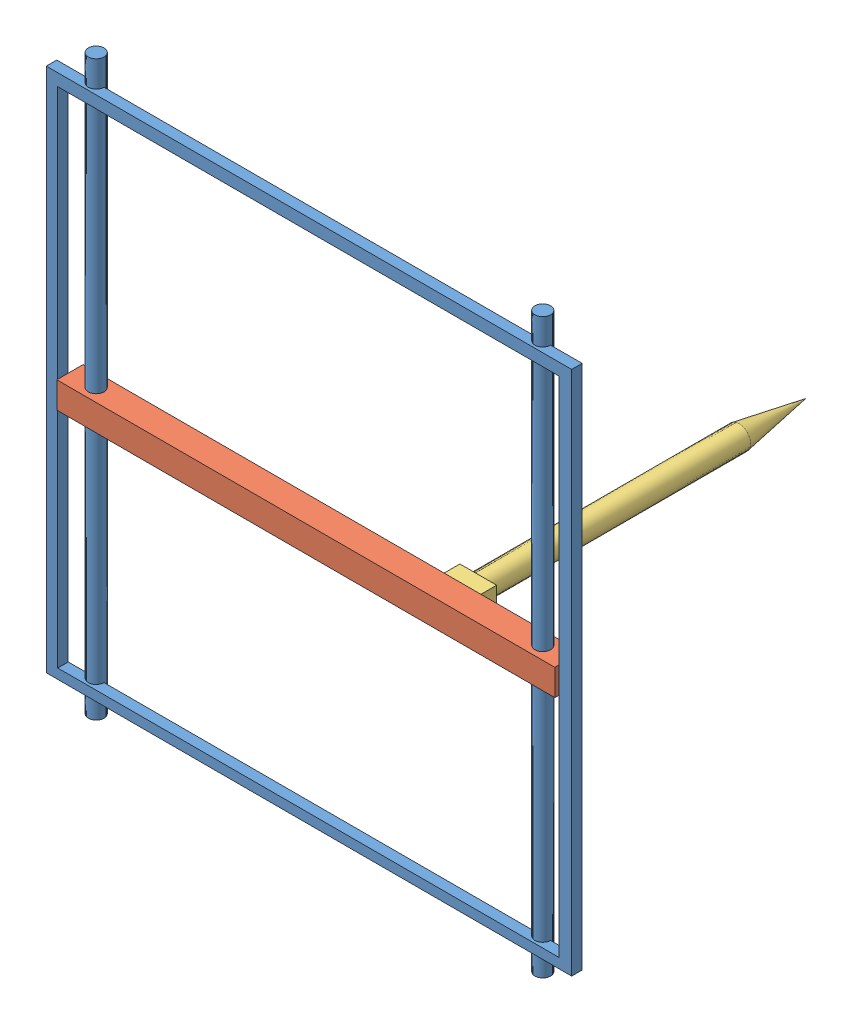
SolidWorks assembly pant1.SLDASM, configuration Default (file format 11000). Lengths in mm.
Overall size (1000 1090 707).
3 component instances, 3 part files, 3 mates.
Components (placement in the parent):
- chassis-1: chassis.SLDPRT [Default] at origin size (1000 1090 35)
- cross beam-3: cross beam.SLDPRT [Default] at (-50 417.9619 25) x (0 0 -1) z (1 0 0) size (50 50 948)
- pointer-1: pointer.SLDPRT [Default] at (637.2364 367.9619 -25) x (1 0 0) z (0 1 0) size (70 656.82 50)
Mates (geometry in assembly coordinates):
- Concentrico3: concentric: cylinder of assembly; cylinder of assembly; cylinder of chassis-1 through (850 970 0) axis (0 -1 0) radius 15; cylinder of cross beam-3 through (850 417.9619 0) axis (0 -1 0) radius 15
- Concentrico4: concentric: cylinder of assembly; cylinder of assembly; cylinder of chassis-1 through (0 970 0) axis (0 -1 0) radius 15; cylinder of cross beam-3 through (0 417.9619 0) axis (0 -1 0) radius 15
- Coincidente2: coincident: line of assembly; line of assembly; line of cross beam-3 through (898 392.9619 -25) axis (-1 0 0); line of pointer-1 through (707.2364 392.9619 -25) axis (-1 0 0)
